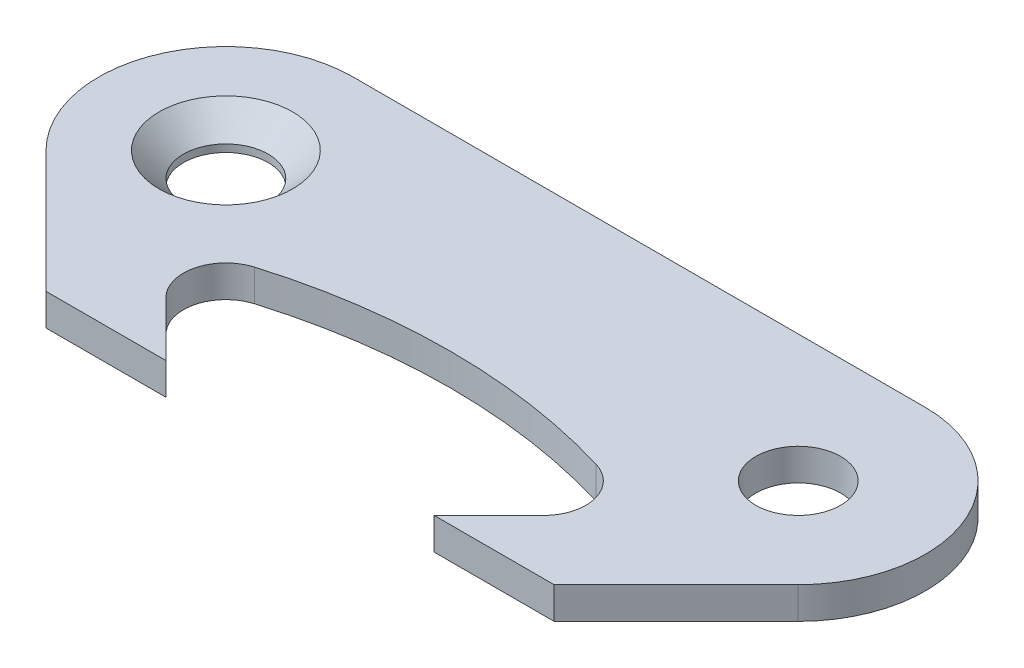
from build123d import *

# Parameters (mm, degrees)
SKETCH1_R      = 4
EXTRUDE1_DEPTH = 3


with BuildPart() as part:
    # Sketch1 → Extrude1 (new body)
    with BuildSketch(Plane(origin=(0, 0, 0), x_dir=(1, 0, 0), z_dir=(0, 1, 0))):
        with BuildLine():
            Line((0, 12), (54, 12))
            ThreePointArc((54, 12), (65.08655439, 4.592201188), (62.485281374, -8.485281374))
            Line((62.485281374, -8.485281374), (50.970562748, -20))
            Line((50.970562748, -20), (39.656854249, -20))
            Line((39.656854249, -20), (44.807611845, -14.849242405))
            ThreePointArc((44.807611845, -14.849242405), (45.858178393, -11.044389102), (43.131429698, -8.190367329))
            ThreePointArc((43.131429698, -8.190367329), (27, -5.816638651), (10.868570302, -8.190367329))
            ThreePointArc((10.868570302, -8.190367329), (8.141821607, -11.044389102), (9.192388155, -14.849242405))
            Line((9.192388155, -14.849242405), (14.343145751, -20))
            Line((14.343145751, -20), (3.029437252, -20))
            Line((3.029437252, -20), (-8.485281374, -8.485281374))
            ThreePointArc((-8.485281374, -8.485281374), (-11.08655439, 4.592201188), (0, 12))
        make_face()
        with Locations(Location((54, 0, 0), (0, 0, 270))):
            Circle(SKETCH1_R, mode=Mode.SUBTRACT)
        with Locations(Location((0, 0, 0), (0, 0, 270))):
            Circle(SKETCH1_R, mode=Mode.SUBTRACT)
    extrude(amount=EXTRUDE1_DEPTH)

    # Sketch4 → CSK for M6 Countersunk Flat Head Screw1 (revolve, cut)
    with BuildSketch(Plane(origin=(0, 3, 0), x_dir=(0, 0, 1), z_dir=(1, 0, 0))):
        Polygon((0, 0), (0, 3), (4, 3), (4, 2.3), (6.3, 0), align=None)
    revolve(axis=Axis((0, 9.35, 0), (0, -1, 0)), mode=Mode.SUBTRACT)


solid = part.part
